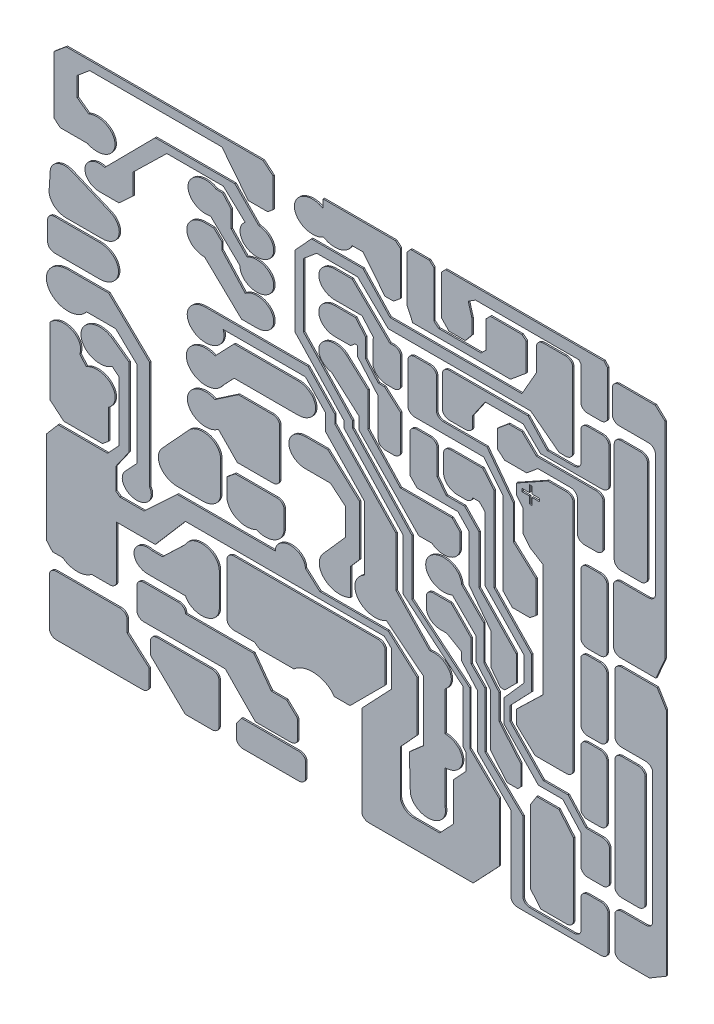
from build123d import *

# Parameters (mm, degrees)
EXTRUSION3_DEPTH    = 0.1
EXTRUSION3_2_DEPTH  = 0.1
EXTRUSION3_3_DEPTH  = 0.1
EXTRUSION3_4_DEPTH  = 0.1
EXTRUSION3_5_DEPTH  = 0.1
EXTRUSION3_6_DEPTH  = 0.1
EXTRUSION3_7_DEPTH  = 0.1
EXTRUSION3_8_DEPTH  = 0.1
EXTRUSION3_9_DEPTH  = 0.1
EXTRUSION3_10_DEPTH = 0.1
EXTRUSION3_11_DEPTH = 0.1
EXTRUSION3_12_DEPTH = 0.1
EXTRUSION3_13_DEPTH = 0.1
EXTRUSION3_14_DEPTH = 0.1
EXTRUSION3_15_DEPTH = 0.1
EXTRUSION3_16_DEPTH = 0.1
EXTRUSION3_17_DEPTH = 0.1
EXTRUSION3_18_DEPTH = 0.1
EXTRUSION3_19_DEPTH = 0.1
EXTRUSION3_20_DEPTH = 0.1
EXTRUSION3_21_DEPTH = 0.1
EXTRUSION3_22_DEPTH = 0.1
EXTRUSION3_23_DEPTH = 0.1
EXTRUSION3_24_DEPTH = 0.1
EXTRUSION3_25_DEPTH = 0.1
EXTRUSION3_26_DEPTH = 0.1
EXTRUSION3_27_DEPTH = 0.1
EXTRUSION3_28_DEPTH = 0.1
EXTRUSION3_29_DEPTH = 0.1
EXTRUSION3_30_DEPTH = 0.1
EXTRUSION3_31_DEPTH = 0.1
EXTRUSION3_32_DEPTH = 0.1
EXTRUSION3_33_DEPTH = 0.1
EXTRUSION3_34_DEPTH = 0.1
EXTRUSION3_35_DEPTH = 0.1
EXTRUSION3_36_DEPTH = 0.1
EXTRUSION3_37_DEPTH = 0.1
EXTRUSION3_38_DEPTH = 0.1
EXTRUSION3_39_DEPTH = 0.1
EXTRUSION3_40_DEPTH = 0.1
EXTRUSION3_41_DEPTH = 0.1
EXTRUSION3_42_DEPTH = 0.1
EXTRUSION3_43_DEPTH = 0.1
ECHELLE2_SCALE_X    = 1.03
ECHELLE2_SCALE_Y    = 0.86
ECHELLE2_SCALE_Z    = 1


with BuildPart() as part:
    # Esquisse4 → Extrusion3 (new body)
    with BuildSketch(Plane.XY):
        with BuildLine():
            Line((5.304256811, 19.782710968), (5.304256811, 17.323051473))
            Line((5.304256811, 17.323051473), (4.886048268, 16.90484293))
            Line((4.886048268, 16.90484293), (2.189324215, 16.90484293))
            Line((2.189324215, 16.90484293), (1.244749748, 17.849417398))
            Line((1.244749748, 17.849417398), (1.244749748, 23.495232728))
            ThreePointArc((1.244749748, 23.495232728), (2.735433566, 23.83894844), (3.294168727, 22.414836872))
            Line((3.294168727, 22.414836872), (3.754963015, 21.778893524))
            ThreePointArc((3.754963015, 21.778893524), (5.495315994, 21.530314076), (5.304256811, 19.782710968))
        make_face()
    extrude(amount=EXTRUSION3_DEPTH)


with BuildPart() as body_2:
    # Esquisse4 → Extrusion3 2 (new body)
    with BuildSketch(Plane.XY):
        with BuildLine():
            Line((8.159611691, 24.735437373), (8.159611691, 15.721101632))
            ThreePointArc((8.159611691, 15.721101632), (7.1608882, 14.244145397), (6.487654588, 15.895085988))
            Line((6.487654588, 15.895085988), (7.265510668, 16.885278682))
            Line((7.265510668, 16.885278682), (7.265510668, 24.072072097))
            Line((7.265510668, 24.072072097), (5.794570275, 25.744906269))
            Line((5.794570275, 25.744906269), (3.759509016, 25.744906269))
            ThreePointArc((3.759509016, 25.744906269), (1.170594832, 25.788310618), (2.4777439, 28.023421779))
            Line((2.4777439, 28.023421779), (5.304256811, 28.023421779))
            Line((5.304256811, 28.023421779), (8.159611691, 24.735437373))
        make_face()
    extrude(amount=EXTRUSION3_2_DEPTH)


with BuildPart() as body_3:
    # Esquisse4 → Extrusion3 3 (new body)
    with BuildSketch(Plane.XY):
        with BuildLine():
            Line((26.234351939, 7.440030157), (26.298853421, 4.671515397))
            ThreePointArc((26.298853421, 4.671515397), (27.683936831, 3.456761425), (28.707594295, 4.988495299))
            Line((28.707594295, 4.988495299), (28.707594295, 7.786235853))
            ThreePointArc((28.707594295, 7.786235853), (29.92978619, 9.008427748), (28.707594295, 10.230619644))
            Line((28.707594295, 10.230619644), (28.707594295, 13.466508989))
            ThreePointArc((28.707594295, 13.466508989), (29.026344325, 14.948417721), (27.652585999, 15.589076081))
            Line((27.652585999, 15.589076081), (25.299345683, 18.539459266))
            Line((25.299345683, 18.539459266), (25.299345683, 22.666557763))
            Line((25.299345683, 22.666557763), (21.04657529, 27.99848335))
            Line((21.04657529, 27.99848335), (21.04657529, 28.707460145))
            Line((21.04657529, 28.707460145), (19.185806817, 31.040405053))
            Line((19.185806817, 31.040405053), (12.058450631, 31.040405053))
            ThreePointArc((12.058450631, 31.040405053), (11.312990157, 28.717940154), (13.270856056, 30.172696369))
            Line((13.270856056, 30.172696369), (19.005379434, 30.172696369))
            Line((19.005379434, 30.172696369), (20.383022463, 28.445471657))
            Line((20.383022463, 28.445471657), (20.383022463, 27.07878426))
            Line((20.383022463, 27.07878426), (23.097556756, 23.675427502))
            Line((23.097556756, 23.675427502), (23.097556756, 18.313534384))
            ThreePointArc((23.097556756, 18.313534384), (22.67184234, 16.349325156), (24.642456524, 15.95431833))
            Line((24.642456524, 15.95431833), (27.230443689, 13.484176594))
            Line((27.230443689, 13.484176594), (27.230443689, 8.483643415))
            Line((27.230443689, 8.483643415), (26.234351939, 7.440030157))
        make_face()
    extrude(amount=EXTRUSION3_3_DEPTH)


with BuildPart() as body_4:
    # Esquisse4 → Extrusion3 4 (new body)
    with BuildSketch(Plane.XY):
        with BuildLine():
            Line((18.475414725, 29.578565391), (14.039868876, 29.578565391))
            Line((14.039868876, 29.578565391), (12.710033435, 27.918640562))
            ThreePointArc((12.710033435, 27.918640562), (10.766673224, 26.373119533), (13.233678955, 26.091753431))
            Line((13.233678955, 26.091753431), (14.039868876, 27.105323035))
            Line((14.039868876, 27.105323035), (18.475414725, 27.105323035))
            ThreePointArc((18.475414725, 27.105323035), (19.712035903, 28.341944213), (18.475414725, 29.578565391))
        make_face()
    extrude(amount=EXTRUSION3_4_DEPTH)


with BuildPart() as body_5:
    # Esquisse4 → Extrusion3 5 (new body)
    with BuildSketch(Plane.XY):
        with BuildLine():
            Line((22.13997135, 16.130453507), (22.13997135, 18.374285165))
            Line((22.13997135, 18.374285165), (22.757757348, 19.22841254))
            Line((22.757757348, 19.22841254), (22.757757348, 23.449301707))
            Line((22.757757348, 23.449301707), (20.556318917, 25.859676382))
            Line((20.556318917, 25.859676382), (19.005379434, 25.859676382))
            ThreePointArc((19.005379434, 25.859676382), (17.847387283, 24.701684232), (19.005379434, 23.543692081))
            Line((19.005379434, 23.543692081), (20.747633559, 23.543692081))
            Line((20.747633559, 23.543692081), (21.7827533, 22.50857234))
            Line((21.7827533, 22.50857234), (21.7827533, 20.252080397))
            Line((21.7827533, 20.252080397), (20.241433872, 18.16266977))
            ThreePointArc((20.241433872, 18.16266977), (20.346098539, 16.357515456), (22.13997135, 16.130453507))
        make_face()
    extrude(amount=EXTRUSION3_5_DEPTH)


with BuildPart() as body_6:
    # Esquisse4 → Extrusion3 6 (new body)
    with BuildSketch(Plane.XY):
        with BuildLine():
            Line((14.10875337, 20.252080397), (17.010353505, 20.252080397))
            ThreePointArc((17.010353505, 20.252080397), (17.363906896, 20.105633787), (17.510353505, 19.752080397))
            Line((17.510353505, 19.752080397), (17.510353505, 18.256156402))
            ThreePointArc((17.510353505, 18.256156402), (16.875021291, 17.132890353), (15.584982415, 17.098636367))
            ThreePointArc((15.584982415, 17.098636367), (14.224165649, 17.080572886), (13.538489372, 18.256156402))
            Line((13.538489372, 18.256156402), (13.538489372, 19.681816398))
            Line((13.538489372, 19.681816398), (14.10875337, 20.252080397))
        make_face()
    extrude(amount=EXTRUSION3_6_DEPTH)


with BuildPart() as body_7:
    # Esquisse4 → Extrusion3 7 (new body)
    with BuildSketch(Plane.XY):
        with BuildLine():
            Line((11.990059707, 37.105055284), (12.61713863, 37.105055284))
            Line((12.61713863, 37.105055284), (13.183371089, 36.454771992))
            Line((13.183371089, 36.454771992), (13.183371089, 35.842473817))
            Line((13.183371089, 35.842473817), (14.810614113, 33.694689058))
            ThreePointArc((14.810614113, 33.694689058), (16.710999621, 33.286992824), (15.623122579, 31.676339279))
            Line((15.623122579, 31.676339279), (14.554116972, 31.676339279))
            Line((14.554116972, 31.676339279), (11.990059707, 34.621001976))
            ThreePointArc((11.990059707, 34.621001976), (10.748033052, 35.86302863), (11.990059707, 37.105055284))
        make_face()
    extrude(amount=EXTRUSION3_7_DEPTH)


with BuildPart() as body_8:
    # Esquisse4 → Extrusion3 8 (new body)
    with BuildSketch(Plane.XY):
        with BuildLine():
            Line((14.450926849, 35.468375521), (12.399096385, 37.828891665))
            ThreePointArc((12.399096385, 37.828891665), (10.851053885, 39.227517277), (12.792475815, 39.991369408))
            Line((12.792475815, 39.991369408), (13.233678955, 39.991369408))
            Line((13.233678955, 39.991369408), (13.839788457, 39.180456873))
            Line((13.839788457, 39.180456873), (13.839788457, 37.758857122))
            Line((13.839788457, 37.758857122), (14.942842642, 36.388657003))
            ThreePointArc((14.942842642, 36.388657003), (16.657359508, 34.880588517), (14.450926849, 35.468375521))
        make_face()
    extrude(amount=EXTRUSION3_8_DEPTH)


with BuildPart() as body_9:
    # Esquisse4 → Extrusion3 9 (new body)
    with BuildSketch(Plane.XY):
        with BuildLine():
            Line((34.67299222, 8.717287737), (34.67299222, 2.583722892))
            Line((34.67299222, 2.583722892), (35.388883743, 1.56851013))
            Line((35.388883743, 1.56851013), (37.155420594, 1.56851013))
            ThreePointArc((37.155420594, 1.56851013), (37.508973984, 1.71495674), (37.655420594, 2.06851013))
            Line((37.655420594, 2.06851013), (37.655420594, 8.081678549))
            Line((37.655420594, 8.081678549), (36.640002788, 9.521652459))
            Line((36.640002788, 9.521652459), (35.096709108, 9.521652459))
            Line((35.096709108, 9.521652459), (34.67299222, 8.717287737))
        make_face()
    extrude(amount=EXTRUSION3_9_DEPTH)


with BuildPart() as body_10:
    # Esquisse4 → Extrusion3 10 (new body)
    with BuildSketch(Plane.XY):
        with BuildLine():
            Line((38.663806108, 15.532381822), (39.483987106, 15.532381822))
            ThreePointArc((39.483987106, 15.532381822), (39.837540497, 15.385935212), (39.983987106, 15.032381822))
            Line((39.983987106, 15.032381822), (39.983987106, 10.472851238))
            ThreePointArc((39.983987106, 10.472851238), (39.837540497, 10.119297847), (39.483987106, 9.972851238))
            Line((39.483987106, 9.972851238), (38.663806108, 9.972851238))
            ThreePointArc((38.663806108, 9.972851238), (38.310252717, 10.119297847), (38.163806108, 10.472851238))
            Line((38.163806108, 10.472851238), (38.163806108, 15.032381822))
            ThreePointArc((38.163806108, 15.032381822), (38.310252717, 15.385935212), (38.663806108, 15.532381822))
        make_face()
    extrude(amount=EXTRUSION3_10_DEPTH)


with BuildPart() as body_11:
    # Esquisse4 → Extrusion3 11 (new body)
    with BuildSketch(Plane.XY):
        with BuildLine():
            Line((13.285235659, 40.518395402), (14.806877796, 38.823997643))
            ThreePointArc((14.806877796, 38.823997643), (16.006266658, 36.873609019), (15.745099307, 39.148326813))
            Line((15.745099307, 39.148326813), (14.088260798, 41.172698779))
            Line((14.088260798, 41.172698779), (8.550123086, 41.172698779))
            Line((8.550123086, 41.172698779), (5.035022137, 36.925423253))
            ThreePointArc((5.035022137, 36.925423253), (3.676567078, 36.156617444), (4.676473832, 34.958014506))
            Line((4.676473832, 34.958014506), (6.023296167, 34.958014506))
            Line((6.023296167, 34.958014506), (6.993680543, 36.024298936))
            Line((6.993680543, 36.024298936), (6.993680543, 37.757231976))
            Line((6.993680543, 37.757231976), (9.358340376, 40.518395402))
            Line((9.358340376, 40.518395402), (13.285235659, 40.518395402))
        make_face()
    extrude(amount=EXTRUSION3_11_DEPTH)


with BuildPart() as body_12:
    # Esquisse4 → Extrusion3 12 (new body)
    with BuildSketch(Plane.XY):
        with BuildLine():
            Line((2.354013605, 44.027142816), (16.050849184, 44.027142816))
            Line((16.050849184, 44.027142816), (16.747298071, 43.330693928))
            Line((16.747298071, 43.330693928), (16.747298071, 40.882612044))
            Line((16.747298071, 40.882612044), (16.367259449, 40.518395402))
            Line((16.367259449, 40.518395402), (15.024456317, 40.518395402))
            Line((15.024456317, 40.518395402), (13.191788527, 43.289452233))
            Line((13.191788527, 43.289452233), (3.990668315, 43.289452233))
            Line((3.990668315, 43.289452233), (3.124097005, 42.422880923))
            Line((3.124097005, 42.422880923), (3.124097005, 40.806533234))
            Line((3.124097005, 40.806533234), (3.916263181, 40.12072385))
            ThreePointArc((3.916263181, 40.12072385), (5.750915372, 38.960873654), (3.834597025, 37.941596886))
            Line((3.834597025, 37.941596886), (1.943711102, 37.941596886))
            Line((1.943711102, 37.941596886), (1.52041727, 38.364890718))
            Line((1.52041727, 38.364890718), (1.52041727, 43.193546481))
            Line((1.52041727, 43.193546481), (2.354013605, 44.027142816))
        make_face()
    extrude(amount=EXTRUSION3_12_DEPTH)


with BuildPart() as body_13:
    # Esquisse4 → Extrusion3 13 (new body)
    with BuildSketch(Plane.XY):
        with BuildLine():
            Line((38.663806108, 21.828619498), (39.483987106, 21.828619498))
            ThreePointArc((39.483987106, 21.828619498), (39.837540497, 21.682172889), (39.983987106, 21.328619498))
            Line((39.983987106, 21.328619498), (39.983987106, 16.520553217))
            ThreePointArc((39.983987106, 16.520553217), (39.837540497, 16.166999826), (39.483987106, 16.020553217))
            Line((39.483987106, 16.020553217), (38.663806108, 16.020553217))
            ThreePointArc((38.663806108, 16.020553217), (38.310252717, 16.166999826), (38.163806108, 16.520553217))
            Line((38.163806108, 16.520553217), (38.163806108, 21.328619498))
            ThreePointArc((38.163806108, 21.328619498), (38.310252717, 21.682172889), (38.663806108, 21.828619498))
        make_face()
    extrude(amount=EXTRUSION3_13_DEPTH)


with BuildPart() as body_14:
    # Esquisse4 → Extrusion3 14 (new body)
    with BuildSketch(Plane.XY):
        with BuildLine():
            Line((12.489755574, 5.183728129), (8.719579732, 5.183728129))
            ThreePointArc((8.719579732, 5.183728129), (8.369172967, 5.038584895), (8.224029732, 4.688178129))
            Line((8.224029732, 4.688178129), (8.224029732, 3.617699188))
            Line((8.224029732, 3.617699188), (10.644366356, 0.812706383))
            Line((10.644366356, 0.812706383), (12.489755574, 0.812706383))
            ThreePointArc((12.489755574, 0.812706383), (12.840162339, 0.957849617), (12.985305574, 1.308256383))
            Line((12.985305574, 1.308256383), (12.985305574, 4.688178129))
            ThreePointArc((12.985305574, 4.688178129), (12.840162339, 5.038584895), (12.489755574, 5.183728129))
        make_face()
    extrude(amount=EXTRUSION3_14_DEPTH)


with BuildPart() as body_15:
    # Esquisse4 → Extrusion3 15 (new body)
    with BuildSketch(Plane.XY):
        with BuildLine():
            Line((9.040313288, 19.066494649), (10.818019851, 21.378964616))
            ThreePointArc((10.818019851, 21.378964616), (12.210528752, 21.900874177), (13.102347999, 20.710861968))
            Line((13.102347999, 20.710861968), (13.102347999, 18.16644321))
            ThreePointArc((13.102347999, 18.16644321), (12.739199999, 17.289726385), (11.862483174, 16.926578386))
            Line((11.862483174, 16.926578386), (10.094414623, 16.926578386))
            ThreePointArc((10.094414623, 16.926578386), (8.901689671, 17.668632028), (9.040313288, 19.066494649))
        make_face()
    extrude(amount=EXTRUSION3_15_DEPTH)


with BuildPart() as body_16:
    # Esquisse4 → Extrusion3 16 (new body)
    with BuildSketch(Plane.XY):
        with BuildLine():
            Line((16.710352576, 26.091753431), (14.330747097, 26.091753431))
            Line((14.330747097, 26.091753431), (12.704808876, 24.767535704))
            ThreePointArc((12.704808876, 24.767535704), (10.798483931, 23.5238913), (12.945326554, 22.76772138))
            Line((12.945326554, 22.76772138), (14.259146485, 21.154550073))
            Line((14.259146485, 21.154550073), (16.710352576, 21.154550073))
            ThreePointArc((16.710352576, 21.154550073), (17.063905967, 21.300996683), (17.210352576, 21.654550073))
            Line((17.210352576, 21.654550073), (17.210352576, 25.591753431))
            ThreePointArc((17.210352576, 25.591753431), (17.063905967, 25.945306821), (16.710352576, 26.091753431))
        make_face()
    extrude(amount=EXTRUSION3_16_DEPTH)


with BuildPart() as body_17:
    # Esquisse4 → Extrusion3 17 (new body)
    with BuildSketch(Plane.XY):
        with BuildLine():
            Line((4.676473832, 31.296328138), (1.56685908, 31.296328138))
            ThreePointArc((1.56685908, 31.296328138), (1.213305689, 31.149881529), (1.06685908, 30.796328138))
            Line((1.06685908, 30.796328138), (1.06685908, 29.157186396))
            ThreePointArc((1.06685908, 29.157186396), (1.213305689, 28.803633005), (1.56685908, 28.657186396))
            Line((1.56685908, 28.657186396), (4.676473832, 28.657186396))
            ThreePointArc((4.676473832, 28.657186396), (5.996044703, 29.976757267), (4.676473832, 31.296328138))
        make_face()
    extrude(amount=EXTRUSION3_17_DEPTH)


with BuildPart() as body_18:
    # Esquisse4 → Extrusion3 18 (new body)
    with BuildSketch(Plane.XY):
        with BuildLine():
            Line((38.663806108, 28.249125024), (39.483987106, 28.249125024))
            ThreePointArc((39.483987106, 28.249125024), (39.837540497, 28.102678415), (39.983987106, 27.749125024))
            Line((39.983987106, 27.749125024), (39.983987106, 22.816790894))
            ThreePointArc((39.983987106, 22.816790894), (39.837540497, 22.463237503), (39.483987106, 22.316790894))
            Line((39.483987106, 22.316790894), (38.663806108, 22.316790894))
            ThreePointArc((38.663806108, 22.316790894), (38.310252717, 22.463237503), (38.163806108, 22.816790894))
            Line((38.163806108, 22.816790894), (38.163806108, 27.749125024))
            ThreePointArc((38.163806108, 27.749125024), (38.310252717, 28.102678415), (38.663806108, 28.249125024))
        make_face()
    extrude(amount=EXTRUSION3_18_DEPTH)


with BuildPart() as body_19:
    # Esquisse4 → Extrusion3 19 (new body)
    with BuildSketch(Plane.XY):
        with BuildLine():
            Line((6.091595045, 5.759335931), (1.686371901, 5.759335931))
            ThreePointArc((1.686371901, 5.759335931), (1.335965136, 5.614192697), (1.190821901, 5.263785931))
            Line((1.190821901, 5.263785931), (1.190821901, 1.308256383))
            ThreePointArc((1.190821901, 1.308256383), (1.335965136, 0.957849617), (1.686371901, 0.812706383))
            Line((1.686371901, 0.812706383), (7.638541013, 0.812706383))
            ThreePointArc((7.638541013, 0.812706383), (7.988947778, 0.957849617), (8.134091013, 1.308256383))
            Line((8.134091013, 1.308256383), (8.134091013, 2.629468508))
            Line((8.134091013, 2.629468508), (6.587145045, 4.266353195))
            Line((6.587145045, 4.266353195), (6.587145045, 5.263785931))
            ThreePointArc((6.587145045, 5.263785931), (6.44200181, 5.614192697), (6.091595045, 5.759335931))
        make_face()
    extrude(amount=EXTRUSION3_19_DEPTH)


with BuildPart() as body_20:
    # Esquisse4 → Extrusion3 20 (new body)
    with BuildSketch(Plane.XY):
        with BuildLine():
            Line((13.007320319, 9.838041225), (13.007320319, 12.598886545))
            ThreePointArc((13.007320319, 12.598886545), (12.020275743, 13.800456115), (10.649918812, 13.06550829))
            Line((10.649918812, 13.06550829), (9.054118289, 11.237906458))
            Line((9.054118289, 11.237906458), (8.33555072, 11.237906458))
            ThreePointArc((8.33555072, 11.237906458), (7.084357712, 10.48446694), (8.030021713, 9.37141948))
            Line((8.030021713, 9.37141948), (10.649918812, 9.37141948))
            ThreePointArc((10.649918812, 9.37141948), (12.020275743, 8.636471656), (13.007320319, 9.838041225))
        make_face()
    extrude(amount=EXTRUSION3_20_DEPTH)


with BuildPart() as body_21:
    # Esquisse4 → Extrusion3 21 (new body)
    with BuildSketch(Plane.XY):
        with BuildLine():
            Line((33.294770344, 7.480250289), (30.959667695, 10.30520257))
            Line((30.959667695, 10.30520257), (30.959667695, 14.720309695))
            Line((30.959667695, 14.720309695), (29.867790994, 16.187683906))
            Line((29.867790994, 16.187683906), (29.867790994, 16.846409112))
            Line((29.867790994, 16.846409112), (28.840778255, 17.558186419))
            Line((28.840778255, 17.558186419), (28.415681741, 17.558186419))
            ThreePointArc((28.415681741, 17.558186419), (27.70857496, 17.851079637), (27.415681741, 18.558186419))
            Line((27.415681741, 18.558186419), (27.415681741, 19.406639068))
            ThreePointArc((27.415681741, 19.406639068), (27.56212835, 19.760192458), (27.915681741, 19.906639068))
            Line((27.915681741, 19.906639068), (29.144650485, 19.906639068))
            Line((29.144650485, 19.906639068), (30.534071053, 18.225750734))
            Line((30.534071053, 18.225750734), (30.534071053, 16.351324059))
            Line((30.534071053, 16.351324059), (31.495750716, 15.187906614))
            Line((31.495750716, 15.187906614), (31.495750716, 10.574515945))
            Line((31.495750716, 10.574515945), (34.133551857, 7.541962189))
            Line((34.133551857, 7.541962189), (34.133551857, 1.710557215))
            ThreePointArc((34.133551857, 1.710557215), (34.279998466, 1.357003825), (34.633551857, 1.210557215))
            Line((34.633551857, 1.210557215), (37.677156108, 1.210557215))
            ThreePointArc((37.677156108, 1.210557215), (38.030709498, 1.357003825), (38.177156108, 1.710557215))
            Line((38.177156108, 1.710557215), (38.177156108, 4.092383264))
            ThreePointArc((38.177156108, 4.092383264), (38.323602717, 4.445936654), (38.677156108, 4.592383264))
            Line((38.677156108, 4.592383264), (39.556559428, 4.592383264))
            ThreePointArc((39.556559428, 4.592383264), (39.910112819, 4.445936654), (40.056559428, 4.092383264))
            Line((40.056559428, 4.092383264), (40.056559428, 1.228484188))
            ThreePointArc((40.056559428, 1.228484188), (39.910112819, 0.874930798), (39.556559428, 0.728484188))
            Line((39.556559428, 0.728484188), (33.794770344, 0.728484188))
            ThreePointArc((33.794770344, 0.728484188), (33.441216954, 0.874930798), (33.294770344, 1.228484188))
            Line((33.294770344, 1.228484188), (33.294770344, 7.480250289))
        make_face()
    extrude(amount=EXTRUSION3_21_DEPTH)


with BuildPart() as body_22:
    # Esquisse4 → Extrusion3 22 (new body)
    with BuildSketch(Plane.XY):
        with BuildLine():
            Line((24.055930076, 14.264261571), (14.046162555, 14.264261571))
            ThreePointArc((14.046162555, 14.264261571), (13.69575579, 14.119118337), (13.550612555, 13.768711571))
            Line((13.550612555, 13.768711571), (13.550612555, 9.398536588))
            ThreePointArc((13.550612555, 9.398536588), (13.69575579, 9.048129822), (14.046162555, 8.902986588))
            Line((14.046162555, 8.902986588), (15.455020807, 8.902986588))
            Line((15.455020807, 8.902986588), (15.820576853, 8.610020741))
            Line((15.820576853, 8.610020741), (18.201768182, 8.610020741))
            ThreePointArc((18.201768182, 8.610020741), (19.6882062, 9.172023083), (21.018285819, 8.302406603))
            Line((21.018285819, 8.302406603), (22.105215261, 8.302406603))
            Line((22.105215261, 8.302406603), (24.551480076, 11.237906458))
            Line((24.551480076, 11.237906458), (24.551480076, 13.768711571))
            ThreePointArc((24.551480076, 13.768711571), (24.406336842, 14.119118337), (24.055930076, 14.264261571))
        make_face()
    extrude(amount=EXTRUSION3_22_DEPTH)


with BuildPart() as body_23:
    # Esquisse4 → Extrusion3 23 (new body)
    with BuildSketch(Plane.XY):
        with BuildLine():
            Line((36.907578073, 10.411348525), (38.172650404, 8.740666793))
            Line((38.172650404, 8.740666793), (38.172650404, 6.314354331))
            ThreePointArc((38.172650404, 6.314354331), (38.319097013, 5.960800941), (38.672650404, 5.814354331))
            Line((38.672650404, 5.814354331), (39.662472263, 5.814354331))
            ThreePointArc((39.662472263, 5.814354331), (40.016025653, 5.960800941), (40.162472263, 6.314354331))
            Line((40.162472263, 6.314354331), (40.162472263, 8.800202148))
            ThreePointArc((40.162472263, 8.800202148), (40.016025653, 9.153755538), (39.662472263, 9.300202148))
            Line((39.662472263, 9.300202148), (38.527819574, 9.300202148))
            Line((38.527819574, 9.300202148), (37.277061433, 10.951980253))
            Line((37.277061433, 10.951980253), (35.54998411, 10.951980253))
            Line((35.54998411, 10.951980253), (33.231795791, 13.839032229))
            Line((33.231795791, 13.839032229), (33.231795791, 14.971536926))
            Line((33.231795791, 14.971536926), (34.737262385, 16.855309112))
            Line((34.737262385, 16.855309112), (34.737262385, 19.570333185))
            Line((34.737262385, 19.570333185), (32.130957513, 22.81620306))
            Line((32.130957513, 22.81620306), (32.130957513, 29.839724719))
            Line((32.130957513, 29.839724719), (31.338064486, 30.966362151))
            Line((31.338064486, 30.966362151), (29.117585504, 30.966362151))
            ThreePointArc((29.117585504, 30.966362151), (28.764032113, 30.819915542), (28.617585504, 30.466362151))
            Line((28.617585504, 30.466362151), (28.617585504, 28.99450928))
            ThreePointArc((28.617585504, 28.99450928), (28.910478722, 28.287402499), (29.617585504, 27.99450928))
            Line((29.617585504, 27.99450928), (30.149139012, 27.99450928))
            ThreePointArc((30.149139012, 27.99450928), (30.473613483, 28.1140933), (30.642880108, 28.415644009))
            Line((30.642880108, 28.415644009), (31.102238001, 28.415644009))
            Line((31.102238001, 28.415644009), (31.500145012, 27.920094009))
            Line((31.500145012, 27.920094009), (31.500145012, 22.586011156))
            Line((31.500145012, 22.586011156), (34.20387358, 19.21881064))
            Line((34.20387358, 19.21881064), (34.20387358, 17.17223595))
            Line((34.20387358, 17.17223595), (32.827825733, 15.298216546))
            Line((32.827825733, 15.298216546), (32.827825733, 13.383297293))
            Line((32.827825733, 13.383297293), (35.214182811, 10.411348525))
            Line((35.214182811, 10.411348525), (36.907578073, 10.411348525))
        make_face()
    extrude(amount=EXTRUSION3_23_DEPTH)


with BuildPart() as body_24:
    # Esquisse4 → Extrusion3 24 (new body)
    with BuildSketch(Plane.XY):
        with BuildLine():
            Line((14.565437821, 2.876788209), (18.520522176, 2.876788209))
            ThreePointArc((18.520522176, 2.876788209), (18.874075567, 2.730341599), (19.020522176, 2.376788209))
            Line((19.020522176, 2.376788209), (19.020522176, 1.225890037))
            ThreePointArc((19.020522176, 1.225890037), (18.874075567, 0.872336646), (18.520522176, 0.725890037))
            Line((18.520522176, 0.725890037), (14.696459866, 0.725890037))
            ThreePointArc((14.696459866, 0.725890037), (14.342906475, 0.872336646), (14.196459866, 1.225890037))
            Line((14.196459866, 1.225890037), (14.196459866, 2.290764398))
            Line((14.196459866, 2.290764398), (14.565437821, 2.876788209))
        make_face()
    extrude(amount=EXTRUSION3_24_DEPTH)


with BuildPart() as body_25:
    # Esquisse4 → Extrusion3 25 (new body)
    with BuildSketch(Plane.XY):
        with BuildLine():
            Line((13.421606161, 5.759335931), (15.53204492, 3.19041947))
            Line((15.53204492, 3.19041947), (17.967057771, 3.19041947))
            ThreePointArc((17.967057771, 3.19041947), (18.320611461, 3.336866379), (18.467057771, 3.690420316))
            Line((18.467057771, 3.690420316), (18.467055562, 4.995728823))
            ThreePointArc((18.467055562, 4.995728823), (18.435066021, 5.171700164), (18.343191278, 5.325154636))
            Line((18.343191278, 5.325154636), (17.692201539, 6.068447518))
            Line((17.692201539, 6.068447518), (16.633473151, 6.068447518))
            Line((16.633473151, 6.068447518), (15.404538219, 8.073500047))
            Line((15.404538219, 8.073500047), (10.653266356, 8.073500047))
            Line((10.653266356, 8.073500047), (10.653266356, 8.114470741))
            ThreePointArc((10.653266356, 8.114470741), (10.506819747, 8.468024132), (10.153266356, 8.614470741))
            Line((10.153266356, 8.614470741), (7.778123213, 8.614470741))
            ThreePointArc((7.778123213, 8.614470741), (7.424569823, 8.468024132), (7.278123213, 8.114470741))
            Line((7.278123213, 8.114470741), (7.278123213, 6.254885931))
            ThreePointArc((7.278123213, 6.254885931), (7.423266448, 5.904479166), (7.773673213, 5.759335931))
            Line((7.773673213, 5.759335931), (13.421606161, 5.759335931))
        make_face()
    extrude(amount=EXTRUSION3_25_DEPTH)


with BuildPart() as body_26:
    # Esquisse4 → Extrusion3 26 (new body)
    with BuildSketch(Plane.XY):
        with BuildLine():
            Line((1.245300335, 34.416193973), (1.166218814, 32.96581242))
            ThreePointArc((1.166218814, 32.96581242), (1.499355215, 32.05838533), (2.387299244, 31.676339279))
            Line((2.387299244, 31.676339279), (4.851255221, 31.676339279))
            ThreePointArc((4.851255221, 31.676339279), (6.01635138, 32.597583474), (5.388621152, 33.943724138))
            Line((5.388621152, 33.943724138), (2.731685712, 35.278047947))
            ThreePointArc((2.731685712, 35.278047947), (1.755625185, 35.248733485), (1.245300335, 34.416193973))
        make_face()
    extrude(amount=EXTRUSION3_26_DEPTH)


with BuildPart() as body_27:
    # Esquisse4 → Extrusion3 27 (new body)
    with BuildSketch(Plane.XY):
        with BuildLine():
            Line((20.241433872, 43.755886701), (25.258316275, 43.755886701))
            Line((25.258316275, 43.755886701), (25.60063397, 43.413569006))
            Line((25.60063397, 43.413569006), (25.60063397, 39.773621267))
            Line((25.60063397, 39.773621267), (25.135406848, 39.308394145))
            Line((25.135406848, 39.308394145), (24.538653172, 39.308394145))
            Line((24.538653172, 39.308394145), (22.993753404, 41.593595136))
            Line((22.993753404, 41.593595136), (22.245747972, 41.593595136))
            ThreePointArc((22.245747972, 41.593595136), (21.40022707, 40.805217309), (20.264798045, 41.022579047))
            ThreePointArc((20.264798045, 41.022579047), (18.233285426, 42.017562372), (20.241433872, 43.058895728))
            Line((20.241433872, 43.058895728), (20.241433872, 43.755886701))
        make_face()
    extrude(amount=EXTRUSION3_27_DEPTH)


with BuildPart() as body_28:
    # Esquisse4 → Extrusion3 28 (new body)
    with BuildSketch(Plane.XY):
        Polygon((26.324358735, 43.755886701), (27.633366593, 43.755886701), (27.937741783, 43.413569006), (27.937741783, 39.549598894), (28.268204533, 39.219136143), (31.226884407, 39.219136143), (31.575860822, 39.640160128), (31.575860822, 41.900508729), (31.870843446, 42.256391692), (34.065406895, 42.256391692), (34.367644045, 41.954154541), (34.367644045, 39.640160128), (33.272010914, 38.544526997), (26.473059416, 38.544526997), (26.069518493, 39.563945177), (26.069518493, 43.413569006), align=None)
    extrude(amount=EXTRUSION3_28_DEPTH)


with BuildPart() as body_29:
    # Esquisse4 → Extrusion3 29 (new body)
    with BuildSketch(Plane.XY):
        with BuildLine():
            Line((28.478543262, 40.091572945), (28.478543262, 43.413569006))
            Line((28.478543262, 43.413569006), (28.753419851, 43.755886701))
            Line((28.753419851, 43.755886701), (39.774332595, 43.755886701))
            Line((39.774332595, 43.755886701), (40.032029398, 43.413569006))
            Line((40.032029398, 43.413569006), (40.032029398, 39.803944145))
            ThreePointArc((40.032029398, 39.803944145), (39.885582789, 39.450390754), (39.532029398, 39.303944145))
            Line((39.532029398, 39.303944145), (38.663806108, 39.303944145))
            ThreePointArc((38.663806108, 39.303944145), (38.310252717, 39.450390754), (38.163806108, 39.803944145))
            Line((38.163806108, 39.803944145), (38.163806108, 42.621044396))
            Line((38.163806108, 42.621044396), (38.026426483, 42.803535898))
            Line((38.026426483, 42.803535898), (30.83840426, 42.803535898))
            Line((30.83840426, 42.803535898), (30.332752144, 42.422880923))
            Line((30.332752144, 42.422880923), (30.585578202, 41.360981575))
            Line((30.585578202, 41.360981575), (30.585578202, 40.124645))
            Line((30.585578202, 40.124645), (30.118753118, 39.454056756))
            Line((30.118753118, 39.454056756), (28.99079683, 39.454056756))
            Line((28.99079683, 39.454056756), (28.478543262, 40.091572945))
        make_face()
    extrude(amount=EXTRUSION3_29_DEPTH)


with BuildPart() as body_30:
    # Esquisse4 → Extrusion3 30 (new body)
    with BuildSketch(Plane.XY):
        with BuildLine():
            Line((40.86468052, 42.704044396), (43.350463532, 42.704044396))
            Line((43.350463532, 42.704044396), (44.026232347, 41.948235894))
            Line((44.026232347, 41.948235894), (44.026232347, 24.784684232))
            Line((44.026232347, 24.784684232), (43.390469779, 23.027246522))
            Line((43.390469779, 23.027246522), (40.944182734, 23.027246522))
            ThreePointArc((40.944182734, 23.027246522), (40.590629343, 23.173693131), (40.444182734, 23.527246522))
            Line((40.444182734, 23.527246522), (40.444182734, 28.01714591))
            ThreePointArc((40.444182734, 28.01714591), (40.590629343, 28.370699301), (40.944182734, 28.51714591))
            Line((40.944182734, 28.51714591), (42.850463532, 28.51714591))
            ThreePointArc((42.850463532, 28.51714591), (43.204016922, 28.66359252), (43.350463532, 29.01714591))
            Line((43.350463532, 29.01714591), (43.350463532, 39.214260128))
            ThreePointArc((43.350463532, 39.214260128), (43.204016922, 39.567813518), (42.850463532, 39.714260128))
            Line((42.850463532, 39.714260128), (40.86468052, 39.714260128))
            ThreePointArc((40.86468052, 39.714260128), (40.51112713, 39.860706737), (40.36468052, 40.214260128))
            Line((40.36468052, 40.214260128), (40.36468052, 42.204044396))
            ThreePointArc((40.36468052, 42.204044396), (40.51112713, 42.557597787), (40.86468052, 42.704044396))
        make_face()
    extrude(amount=EXTRUSION3_30_DEPTH)


with BuildPart() as body_31:
    # Esquisse4 → Extrusion3 31 (new body)
    with BuildSketch(Plane.XY):
        with BuildLine():
            Line((31.870843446, 10.951980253), (33.033076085, 9.300202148))
            Line((33.033076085, 9.300202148), (33.781420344, 9.300202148))
            Line((33.781420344, 9.300202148), (33.993043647, 9.566678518))
            Line((33.993043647, 9.566678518), (33.993043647, 11.22245083))
            Line((33.993043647, 11.22245083), (32.489094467, 13.359880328))
            Line((32.489094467, 13.359880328), (32.489094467, 15.456489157))
            Line((32.489094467, 15.456489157), (31.412807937, 16.986119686))
            Line((31.412807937, 16.986119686), (31.412807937, 19.842763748))
            Line((31.412807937, 19.842763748), (29.870768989, 21.69061986))
            ThreePointArc((29.870768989, 21.69061986), (27.53671871, 22.269022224), (29.223015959, 20.554746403))
            Line((29.223015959, 20.554746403), (30.889148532, 18.558186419))
            Line((30.889148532, 18.558186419), (30.889148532, 16.703014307))
            Line((30.889148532, 16.703014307), (31.870843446, 15.307818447))
            Line((31.870843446, 15.307818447), (31.870843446, 10.951980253))
        make_face()
    extrude(amount=EXTRUSION3_31_DEPTH)


with BuildPart() as body_32:
    # Esquisse4 → Extrusion3 32 (new body)
    with BuildSketch(Plane.XY):
        with BuildLine():
            Line((31.907158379, 16.93944259), (32.57617701, 15.881446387))
            Line((32.57617701, 15.881446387), (32.875204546, 15.881446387))
            Line((32.875204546, 15.881446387), (33.67305446, 16.840447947))
            Line((33.67305446, 16.840447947), (33.67305446, 18.966535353))
            Line((33.67305446, 18.966535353), (31.076991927, 22.199649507))
            Line((31.076991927, 22.199649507), (31.076991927, 26.226925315))
            Line((31.076991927, 26.226925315), (30.07581074, 27.473787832))
            Line((30.07581074, 27.473787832), (28.792863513, 27.473787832))
            Line((28.792863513, 27.473787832), (28.172122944, 28.455436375))
            Line((28.172122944, 28.455436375), (28.172122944, 30.533712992))
            ThreePointArc((28.172122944, 30.533712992), (28.025676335, 30.887266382), (27.672122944, 31.033712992))
            Line((27.672122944, 31.033712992), (26.767656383, 31.033712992))
            ThreePointArc((26.767656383, 31.033712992), (26.414102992, 30.887266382), (26.267656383, 30.533712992))
            Line((26.267656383, 30.533712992), (26.267656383, 27.432226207))
            Line((26.267656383, 27.432226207), (26.772303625, 26.803742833))
            Line((26.772303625, 26.803742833), (29.613135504, 26.803742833))
            Line((29.613135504, 26.803742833), (30.371183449, 25.859676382))
            Line((30.371183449, 25.859676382), (30.371183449, 21.999347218))
            Line((30.371183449, 21.999347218), (31.907158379, 19.570333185))
            Line((31.907158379, 19.570333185), (31.907158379, 16.93944259))
        make_face()
    extrude(amount=EXTRUSION3_32_DEPTH)


with BuildPart() as body_33:
    # Esquisse4 → Extrusion3 33 (new body)
    with BuildSketch(Plane.XY):
        with BuildLine():
            Line((25.124589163, 28.211867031), (24.568157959, 28.211867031))
            ThreePointArc((24.568157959, 28.211867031), (24.214604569, 28.358313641), (24.068157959, 28.711867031))
            Line((24.068157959, 28.711867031), (24.068157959, 31.827740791))
            Line((24.068157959, 31.827740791), (22.619524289, 33.822736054))
            Line((22.619524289, 33.822736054), (22.619524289, 34.610432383))
            Line((22.619524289, 34.610432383), (22.444615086, 34.610432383))
            Line((22.444615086, 34.610432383), (22.141918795, 34.307736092))
            Line((22.141918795, 34.307736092), (21.047429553, 34.307736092))
            ThreePointArc((21.047429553, 34.307736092), (19.931108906, 35.424056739), (21.047429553, 36.540377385))
            Line((21.047429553, 36.540377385), (22.476208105, 36.540377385))
            Line((22.476208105, 36.540377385), (23.186550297, 35.562125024))
            Line((23.186550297, 35.562125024), (23.186550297, 33.981358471))
            Line((23.186550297, 33.981358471), (24.077057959, 32.754990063))
            Line((24.077057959, 32.754990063), (24.498854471, 32.754990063))
            Line((24.498854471, 32.754990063), (25.624589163, 31.566222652))
            Line((25.624589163, 31.566222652), (25.624589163, 28.711867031))
            ThreePointArc((25.624589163, 28.711867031), (25.478142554, 28.358313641), (25.124589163, 28.211867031))
        make_face()
    extrude(amount=EXTRUSION3_33_DEPTH)


with BuildPart() as body_34:
    # Esquisse4 → Extrusion3 34 (new body)
    with BuildSketch(Plane.XY):
        with BuildLine():
            Line((25.601771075, 26.114293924), (23.348410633, 29.000963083))
            Line((23.348410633, 29.000963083), (23.348410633, 31.835451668))
            Line((23.348410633, 31.835451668), (21.866709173, 33.44362448))
            ThreePointArc((21.866709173, 33.44362448), (20.074842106, 33.238162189), (20.817376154, 31.594493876))
            Line((20.817376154, 31.594493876), (22.7279543, 29.578565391))
            Line((22.7279543, 29.578565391), (22.7279543, 28.563507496))
            Line((22.7279543, 28.563507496), (26.885538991, 23.433450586))
            Line((26.885538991, 23.433450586), (27.817781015, 23.433450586))
            ThreePointArc((27.817781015, 23.433450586), (29.069671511, 23.195058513), (29.774791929, 24.256597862))
            Line((29.774791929, 24.256597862), (29.774791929, 25.411332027))
            Line((29.774791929, 25.411332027), (29.207582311, 26.114293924))
            Line((29.207582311, 26.114293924), (25.601771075, 26.114293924))
        make_face()
    extrude(amount=EXTRUSION3_34_DEPTH)


with BuildPart() as body_35:
    # Esquisse4 → Extrusion3 35 (new body)
    with BuildSketch(Plane.XY):
        with BuildLine():
            Line((38.428193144, 29.680879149), (39.223530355, 29.680879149))
            ThreePointArc((39.223530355, 29.680879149), (39.577083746, 29.827325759), (39.723530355, 30.180879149))
            Line((39.723530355, 30.180879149), (39.723530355, 33.570221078))
            ThreePointArc((39.723530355, 33.570221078), (39.577083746, 33.923774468), (39.223530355, 34.070221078))
            Line((39.223530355, 34.070221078), (35.086681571, 34.070221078))
            Line((35.086681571, 34.070221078), (34.065406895, 35.240990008))
            Line((34.065406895, 35.240990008), (33.13963709, 35.240990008))
            Line((33.13963709, 35.240990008), (32.372106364, 34.473459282))
            Line((32.372106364, 34.473459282), (32.372106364, 32.95359813))
            Line((32.372106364, 32.95359813), (32.864018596, 32.461685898))
            Line((32.864018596, 32.461685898), (34.399254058, 32.461685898))
            Line((34.399254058, 32.461685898), (35.175749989, 33.238181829))
            Line((35.175749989, 33.238181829), (37.428193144, 33.238181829))
            ThreePointArc((37.428193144, 33.238181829), (37.781746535, 33.091735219), (37.928193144, 32.738181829))
            Line((37.928193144, 32.738181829), (37.928193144, 30.180879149))
            ThreePointArc((37.928193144, 30.180879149), (38.074639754, 29.827325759), (38.428193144, 29.680879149))
        make_face()
    extrude(amount=EXTRUSION3_35_DEPTH)


with BuildPart() as body_36:
    # Esquisse4 → Extrusion3 36 (new body)
    with BuildSketch(Plane.XY):
        with BuildLine():
            Line((38.672706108, 38.356974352), (39.624393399, 38.356974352))
            ThreePointArc((39.624393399, 38.356974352), (39.97794679, 38.210527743), (40.124393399, 37.856974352))
            Line((40.124393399, 37.856974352), (40.124393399, 34.929964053))
            ThreePointArc((40.124393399, 34.929964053), (39.97794679, 34.576410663), (39.624393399, 34.429964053))
            Line((39.624393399, 34.429964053), (35.362082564, 34.429964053))
            Line((35.362082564, 34.429964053), (34.156859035, 35.85254043))
            Line((34.156859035, 35.85254043), (31.507846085, 35.85254043))
            Line((31.507846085, 35.85254043), (30.642935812, 34.346933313))
            Line((30.642935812, 34.346933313), (30.642935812, 33.539363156))
            ThreePointArc((30.642935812, 33.539363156), (30.496489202, 33.185809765), (30.142935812, 33.039363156))
            Line((30.142935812, 33.039363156), (29.039976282, 33.039363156))
            ThreePointArc((29.039976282, 33.039363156), (28.686422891, 33.185809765), (28.539976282, 33.539363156))
            Line((28.539976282, 33.539363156), (28.539976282, 36.1394216))
            ThreePointArc((28.539976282, 36.1394216), (28.686422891, 36.49297499), (29.039976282, 36.6394216))
            Line((29.039976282, 36.6394216), (34.493682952, 36.6394216))
            Line((34.493682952, 36.6394216), (35.827414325, 34.936527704))
            Line((35.827414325, 34.936527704), (37.672706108, 34.936527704))
            ThreePointArc((37.672706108, 34.936527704), (38.026259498, 35.082974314), (38.172706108, 35.436527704))
            Line((38.172706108, 35.436527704), (38.172706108, 37.856974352))
            ThreePointArc((38.172706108, 37.856974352), (38.319152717, 38.210527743), (38.672706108, 38.356974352))
        make_face()
    extrude(amount=EXTRUSION3_36_DEPTH)


with BuildPart() as body_37:
    # Esquisse4 → Extrusion3 37 (new body)
    with BuildSketch(Plane.XY):
        with BuildLine():
            Line((33.67305446, 13.879192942), (34.986205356, 12.412728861))
            Line((34.986205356, 12.412728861), (37.134532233, 12.412728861))
            ThreePointArc((37.134532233, 12.412728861), (37.488085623, 12.559175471), (37.634532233, 12.912728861))
            Line((37.634532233, 12.912728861), (37.634532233, 32.263140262))
            ThreePointArc((37.634532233, 32.263140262), (37.488085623, 32.616693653), (37.134532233, 32.763140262))
            Line((37.134532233, 32.763140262), (35.868116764, 32.763140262))
            Line((35.868116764, 32.763140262), (33.67305446, 31.296328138))
            Line((33.67305446, 31.296328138), (33.67305446, 30.470812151))
            Line((33.67305446, 30.470812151), (34.147959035, 29.76012459))
            Line((34.147959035, 29.76012459), (34.147959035, 27.92969591))
            Line((34.147959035, 27.92969591), (34.637404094, 27.197248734))
            Line((34.637404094, 27.197248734), (35.54998411, 26.523639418))
            Line((35.54998411, 26.523639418), (35.54998411, 17.144504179))
            Line((35.54998411, 17.144504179), (33.67305446, 14.971536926))
            Line((33.67305446, 14.971536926), (33.67305446, 13.879192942))
        make_face()
        Polygon((34.586350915, 30.91240021), (34.586350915, 30.331681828), (34.76766589, 30.331681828), (34.76766589, 30.91240021), (35.281054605, 30.91240021), (35.281054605, 31.155625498), (34.76766589, 31.155625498), (34.76766589, 31.73634388), (34.586350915, 31.73634388), (34.586350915, 31.155625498), (34.0729622, 31.155625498), (34.0729622, 30.91240021), align=None, mode=Mode.SUBTRACT)
    extrude(amount=EXTRUSION3_37_DEPTH)


with BuildPart() as body_38:
    # Esquisse4 → Extrusion3 38 (new body)
    with BuildSketch(Plane.XY):
        with BuildLine():
            Line((22.640051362, 39.563945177), (24.765357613, 37.100870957))
            Line((24.765357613, 37.100870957), (34.67299222, 37.100870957))
            Line((34.67299222, 37.100870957), (36.657418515, 35.285465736))
            Line((36.657418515, 35.285465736), (37.100091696, 35.285465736))
            ThreePointArc((37.100091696, 35.285465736), (37.431225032, 35.415604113), (37.589805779, 35.734096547))
            Line((37.589805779, 35.734096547), (37.589805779, 42.032094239))
            ThreePointArc((37.589805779, 42.032094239), (37.444662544, 42.382501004), (37.094255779, 42.527644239))
            Line((37.094255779, 42.527644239), (35.582231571, 42.527644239))
            ThreePointArc((35.582231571, 42.527644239), (35.231824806, 42.382501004), (35.086681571, 42.032094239))
            Line((35.086681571, 42.032094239), (35.086681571, 40.124645))
            Line((35.086681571, 40.124645), (34.065406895, 37.981970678))
            Line((34.065406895, 37.981970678), (24.884397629, 37.981970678))
            Line((24.884397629, 37.981970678), (22.998649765, 40.387307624))
            Line((22.998649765, 40.387307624), (19.426010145, 40.387307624))
            Line((19.426010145, 40.387307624), (18.265686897, 38.883095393))
            Line((18.265686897, 38.883095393), (18.265686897, 32.990706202))
            Line((18.265686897, 32.990706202), (21.669935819, 28.648468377))
            Line((21.669935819, 28.648468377), (21.669935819, 28.095427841))
            Line((21.669935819, 28.095427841), (25.795084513, 22.833657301))
            Line((25.795084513, 22.833657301), (25.795084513, 18.575140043))
            Line((25.795084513, 18.575140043), (29.972732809, 14.397491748))
            Line((29.972732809, 14.397491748), (29.972732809, 10.054381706))
            Line((29.972732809, 10.054381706), (30.185264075, 9.738003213))
            Line((30.185264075, 9.738003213), (30.185264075, 8.407738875))
            Line((30.185264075, 8.407738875), (29.302441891, 7.263271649))
            Line((29.302441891, 7.263271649), (29.302441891, 4.072365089))
            Line((29.302441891, 4.072365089), (28.354036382, 2.8515106))
            Line((28.354036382, 2.8515106), (26.59173397, 2.8515106))
            ThreePointArc((26.59173397, 2.8515106), (25.890920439, 3.141797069), (25.60063397, 3.8426106))
            Line((25.60063397, 3.8426106), (25.60063397, 7.428838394))
            Line((25.60063397, 7.428838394), (26.772303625, 8.959684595))
            Line((26.772303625, 8.959684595), (26.772303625, 13.134505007))
            Line((26.772303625, 13.134505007), (24.762564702, 15.278226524))
            Line((24.762564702, 15.278226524), (20.001574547, 15.278226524))
            Line((20.001574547, 15.278226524), (18.998061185, 16.348640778))
            ThreePointArc((18.998061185, 16.348640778), (17.950749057, 17.395952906), (16.903436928, 16.348640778))
            Line((16.903436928, 16.348640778), (10.079627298, 16.348640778))
            Line((10.079627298, 16.348640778), (7.773673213, 13.768711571))
            Line((7.773673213, 13.768711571), (6.091595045, 13.768711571))
            Line((6.091595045, 13.768711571), (5.80415847, 14.02562387))
            Line((5.80415847, 14.02562387), (5.80415847, 15.813433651))
            Line((5.80415847, 15.813433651), (6.726802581, 17.385669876))
            Line((6.726802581, 17.385669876), (6.726802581, 23.885047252))
            Line((6.726802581, 23.885047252), (5.565003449, 24.885979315))
            ThreePointArc((5.565003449, 24.885979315), (3.381503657, 23.890415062), (5.556841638, 22.877141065))
            Line((5.556841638, 22.877141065), (6.023835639, 22.410147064))
            Line((6.023835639, 22.410147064), (6.023835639, 17.432155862))
            Line((6.023835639, 17.432155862), (5.23299783, 16.412960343))
            Line((5.23299783, 16.412960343), (1.795073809, 16.412960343))
            Line((1.795073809, 16.412960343), (0.971260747, 15.249782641))
            Line((0.971260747, 15.249782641), (0.971260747, 7.603905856))
            Line((0.971260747, 7.603905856), (1.409678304, 7.010777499))
            Line((1.409678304, 7.010777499), (2.122744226, 7.010777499))
            ThreePointArc((2.122744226, 7.010777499), (3.124097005, 6.613333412), (4.125449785, 7.010777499))
            Line((4.125449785, 7.010777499), (5.3726891, 7.010777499))
            ThreePointArc((5.3726891, 7.010777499), (5.723095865, 7.155920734), (5.8682391, 7.506327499))
            Line((5.8682391, 7.506327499), (5.8682391, 11.821707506))
            Line((5.8682391, 11.821707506), (8.550123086, 11.821707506))
            Line((8.550123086, 11.821707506), (10.649918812, 14.743413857))
            Line((10.649918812, 14.743413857), (24.490744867, 14.743413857))
            Line((24.490744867, 14.743413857), (24.984085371, 14.17166836))
            Line((24.984085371, 14.17166836), (24.984085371, 11.21269334))
            Line((24.984085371, 11.21269334), (22.923636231, 8.610020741))
            Line((22.923636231, 8.610020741), (22.923636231, 1.127405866))
            ThreePointArc((22.923636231, 1.127405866), (23.068779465, 0.776999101), (23.419186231, 0.631855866))
            Line((23.419186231, 0.631855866), (30.671633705, 0.631855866))
            Line((30.671633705, 0.631855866), (32.49041089, 2.929258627))
            Line((32.49041089, 2.929258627), (32.49041089, 7.813108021))
            Line((32.49041089, 7.813108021), (30.440883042, 10.188360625))
            Line((30.440883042, 10.188360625), (30.440883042, 14.57275309))
            Line((30.440883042, 14.57275309), (26.415859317, 18.556707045))
            Line((26.415859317, 18.556707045), (26.415859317, 23.16347537))
            Line((26.415859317, 23.16347537), (22.290710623, 28.42524591))
            Line((22.290710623, 28.42524591), (22.290710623, 28.966204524))
            Line((22.290710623, 28.966204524), (18.866436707, 33.333984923))
            Line((18.866436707, 33.333984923), (18.866436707, 38.642795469))
            Line((18.866436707, 38.642795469), (19.787586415, 39.563945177))
            Line((19.787586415, 39.563945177), (22.640051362, 39.563945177))
        make_face()
    extrude(amount=EXTRUSION3_38_DEPTH)


with BuildPart() as body_39:
    # Esquisse4 → Extrusion3 39 (new body)
    with BuildSketch(Plane.XY):
        with BuildLine():
            Line((41.031632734, 22.405697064), (43.477919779, 22.405697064))
            Line((43.477919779, 22.405697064), (44.113682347, 21.150100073))
            Line((44.113682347, 21.150100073), (44.113682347, 1.951212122))
            Line((44.113682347, 1.951212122), (42.942363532, 1.122955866))
            Line((42.942363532, 1.122955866), (41.031632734, 1.122955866))
            ThreePointArc((41.031632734, 1.122955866), (40.678079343, 1.269402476), (40.531632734, 1.622955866))
            Line((40.531632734, 1.622955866), (40.531632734, 4.282440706))
            ThreePointArc((40.531632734, 4.282440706), (40.678079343, 4.635994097), (41.031632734, 4.782440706))
            Line((41.031632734, 4.782440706), (42.664105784, 4.782440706))
            ThreePointArc((42.664105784, 4.782440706), (43.017659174, 4.928887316), (43.164105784, 5.282440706))
            Line((43.164105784, 5.282440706), (43.164105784, 16.110470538))
            ThreePointArc((43.164105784, 16.110470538), (43.017659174, 16.464023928), (42.664105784, 16.610470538))
            Line((42.664105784, 16.610470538), (41.031632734, 16.610470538))
            ThreePointArc((41.031632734, 16.610470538), (40.678079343, 16.756917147), (40.531632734, 17.110470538))
            Line((40.531632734, 17.110470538), (40.531632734, 21.905697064))
            ThreePointArc((40.531632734, 21.905697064), (40.678079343, 22.259250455), (41.031632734, 22.405697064))
        make_face()
    extrude(amount=EXTRUSION3_39_DEPTH)


with BuildPart() as body_40:
    # Esquisse4 → Extrusion3 40 (new body)
    with BuildSketch(Plane.XY):
        with BuildLine():
            Line((40.991881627, 38.729885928), (42.306345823, 38.729885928))
            ThreePointArc((42.306345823, 38.729885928), (42.659899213, 38.583439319), (42.806345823, 38.229885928))
            Line((42.806345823, 38.229885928), (42.806345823, 29.839724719))
            ThreePointArc((42.806345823, 29.839724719), (42.659899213, 29.486171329), (42.306345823, 29.339724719))
            Line((42.306345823, 29.339724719), (40.991881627, 29.339724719))
            ThreePointArc((40.991881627, 29.339724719), (40.638328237, 29.486171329), (40.491881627, 29.839724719))
            Line((40.491881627, 29.839724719), (40.491881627, 38.229885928))
            ThreePointArc((40.491881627, 38.229885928), (40.638328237, 38.583439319), (40.991881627, 38.729885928))
        make_face()
    extrude(amount=EXTRUSION3_40_DEPTH)


with BuildPart() as body_41:
    # Esquisse4 → Extrusion3 41 (new body)
    with BuildSketch(Plane.XY):
        with BuildLine():
            Line((41.031632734, 15.95876833), (42.147341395, 15.95876833))
            ThreePointArc((42.147341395, 15.95876833), (42.500894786, 15.812321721), (42.647341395, 15.45876833))
            Line((42.647341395, 15.45876833), (42.647341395, 6.254885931))
            ThreePointArc((42.647341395, 6.254885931), (42.500894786, 5.901332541), (42.147341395, 5.754885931))
            Line((42.147341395, 5.754885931), (41.031632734, 5.754885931))
            ThreePointArc((41.031632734, 5.754885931), (40.678079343, 5.901332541), (40.531632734, 6.254885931))
            Line((40.531632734, 6.254885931), (40.531632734, 15.45876833))
            ThreePointArc((40.531632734, 15.45876833), (40.678079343, 15.812321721), (41.031632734, 15.95876833))
        make_face()
    extrude(amount=EXTRUSION3_41_DEPTH)


with BuildPart() as body_42:
    # Esquisse4 → Extrusion3 42 (new body)
    with BuildSketch(Plane.XY):
        with BuildLine():
            Line((24.878697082, 36.114315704), (25.132921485, 36.114315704))
            ThreePointArc((25.132921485, 36.114315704), (25.486474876, 35.967869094), (25.632921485, 35.614315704))
            Line((25.632921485, 35.614315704), (25.632921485, 33.505903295))
            ThreePointArc((25.632921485, 33.505903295), (25.486474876, 33.152349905), (25.132921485, 33.005903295))
            Line((25.132921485, 33.005903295), (24.691499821, 33.005903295))
            ThreePointArc((24.691499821, 33.005903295), (23.98439304, 33.298796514), (23.691499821, 34.005903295))
            Line((23.691499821, 34.005903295), (23.691499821, 35.614315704))
            ThreePointArc((23.691499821, 35.614315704), (23.705467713, 35.731673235), (23.746590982, 35.842473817))
            Line((23.746590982, 35.842473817), (22.936947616, 36.951367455))
            Line((22.936947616, 36.951367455), (21.049441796, 36.951367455))
            ThreePointArc((21.049441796, 36.951367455), (19.93312115, 38.067688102), (21.049441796, 39.184008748))
            Line((21.049441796, 39.184008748), (22.249707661, 39.184008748))
            Line((22.249707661, 39.184008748), (24.878697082, 36.114315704))
        make_face()
    extrude(amount=EXTRUSION3_42_DEPTH)


with BuildPart() as body_43:
    # Esquisse4 → Extrusion3 43 (new body)
    with BuildSketch(Plane.XY):
        with BuildLine():
            Line((26.637532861, 36.192454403), (27.621585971, 36.192454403))
            ThreePointArc((27.621585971, 36.192454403), (27.975139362, 36.046007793), (28.121585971, 35.692454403))
            Line((28.121585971, 35.692454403), (28.121585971, 33.181306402))
            ThreePointArc((28.121585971, 33.181306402), (28.26803258, 32.827753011), (28.621585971, 32.681306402))
            Line((28.621585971, 32.681306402), (31.633656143, 32.681306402))
            Line((31.633656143, 32.681306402), (33.470087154, 29.75567459))
            Line((33.470087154, 29.75567459), (33.470087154, 26.93310988))
            Line((33.470087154, 26.93310988), (35.04448456, 25.215047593))
            Line((35.04448456, 25.215047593), (35.04448456, 22.545419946))
            Line((35.04448456, 22.545419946), (34.609879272, 22.147156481))
            Line((34.609879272, 22.147156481), (33.401979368, 22.147156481))
            Line((33.401979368, 22.147156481), (32.754451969, 22.953581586))
            Line((32.754451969, 22.953581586), (32.754451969, 29.847980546))
            Line((32.754451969, 29.847980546), (31.414076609, 31.82254418))
            Line((31.414076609, 31.82254418), (26.637532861, 31.82254418))
            ThreePointArc((26.637532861, 31.82254418), (26.28397947, 31.968990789), (26.137532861, 32.32254418))
            Line((26.137532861, 32.32254418), (26.137532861, 35.692454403))
            ThreePointArc((26.137532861, 35.692454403), (26.28397947, 36.046007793), (26.637532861, 36.192454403))
        make_face()
    extrude(amount=EXTRUSION3_43_DEPTH)


with BuildPart() as body_32_1:
    # Echelle2: scaled about (0, 0, 0)
    add(body_32.part.scale((ECHELLE2_SCALE_X, ECHELLE2_SCALE_Y, ECHELLE2_SCALE_Z), about=(0, 0, 0)))


with BuildPart() as body_21_1:
    # Echelle2: scaled about (0, 0, 0)
    add(body_21.part.scale((ECHELLE2_SCALE_X, ECHELLE2_SCALE_Y, ECHELLE2_SCALE_Z), about=(0, 0, 0)))


with BuildPart() as body_11_1:
    # Echelle2: scaled about (0, 0, 0)
    add(body_11.part.scale((ECHELLE2_SCALE_X, ECHELLE2_SCALE_Y, ECHELLE2_SCALE_Z), about=(0, 0, 0)))


with BuildPart() as body_8_1:
    # Echelle2: scaled about (0, 0, 0)
    add(body_8.part.scale((ECHELLE2_SCALE_X, ECHELLE2_SCALE_Y, ECHELLE2_SCALE_Z), about=(0, 0, 0)))


with BuildPart() as body_28_1:
    # Echelle2: scaled about (0, 0, 0)
    add(body_28.part.scale((ECHELLE2_SCALE_X, ECHELLE2_SCALE_Y, ECHELLE2_SCALE_Z), about=(0, 0, 0)))


with BuildPart() as body_27_1:
    # Echelle2: scaled about (0, 0, 0)
    add(body_27.part.scale((ECHELLE2_SCALE_X, ECHELLE2_SCALE_Y, ECHELLE2_SCALE_Z), about=(0, 0, 0)))


with BuildPart() as body_42_1:
    # Echelle2: scaled about (0, 0, 0)
    add(body_42.part.scale((ECHELLE2_SCALE_X, ECHELLE2_SCALE_Y, ECHELLE2_SCALE_Z), about=(0, 0, 0)))


with BuildPart() as body_33_1:
    # Echelle2: scaled about (0, 0, 0)
    add(body_33.part.scale((ECHELLE2_SCALE_X, ECHELLE2_SCALE_Y, ECHELLE2_SCALE_Z), about=(0, 0, 0)))


with BuildPart() as body_34_1:
    # Echelle2: scaled about (0, 0, 0)
    add(body_34.part.scale((ECHELLE2_SCALE_X, ECHELLE2_SCALE_Y, ECHELLE2_SCALE_Z), about=(0, 0, 0)))


with BuildPart() as body_31_1:
    # Echelle2: scaled about (0, 0, 0)
    add(body_31.part.scale((ECHELLE2_SCALE_X, ECHELLE2_SCALE_Y, ECHELLE2_SCALE_Z), about=(0, 0, 0)))


with BuildPart() as body_37_1:
    # Echelle2: scaled about (0, 0, 0)
    add(body_37.part.scale((ECHELLE2_SCALE_X, ECHELLE2_SCALE_Y, ECHELLE2_SCALE_Z), about=(0, 0, 0)))


with BuildPart() as body_29_1:
    # Echelle2: scaled about (0, 0, 0)
    add(body_29.part.scale((ECHELLE2_SCALE_X, ECHELLE2_SCALE_Y, ECHELLE2_SCALE_Z), about=(0, 0, 0)))


with BuildPart() as body_35_1:
    # Echelle2: scaled about (0, 0, 0)
    add(body_35.part.scale((ECHELLE2_SCALE_X, ECHELLE2_SCALE_Y, ECHELLE2_SCALE_Z), about=(0, 0, 0)))


with BuildPart() as body_40_1:
    # Echelle2: scaled about (0, 0, 0)
    add(body_40.part.scale((ECHELLE2_SCALE_X, ECHELLE2_SCALE_Y, ECHELLE2_SCALE_Z), about=(0, 0, 0)))


with BuildPart() as body_30_1:
    # Echelle2: scaled about (0, 0, 0)
    add(body_30.part.scale((ECHELLE2_SCALE_X, ECHELLE2_SCALE_Y, ECHELLE2_SCALE_Z), about=(0, 0, 0)))


with BuildPart() as body_41_1:
    # Echelle2: scaled about (0, 0, 0)
    add(body_41.part.scale((ECHELLE2_SCALE_X, ECHELLE2_SCALE_Y, ECHELLE2_SCALE_Z), about=(0, 0, 0)))


with BuildPart() as body_13_1:
    # Echelle2: scaled about (0, 0, 0)
    add(body_13.part.scale((ECHELLE2_SCALE_X, ECHELLE2_SCALE_Y, ECHELLE2_SCALE_Z), about=(0, 0, 0)))


with BuildPart() as body_18_1:
    # Echelle2: scaled about (0, 0, 0)
    add(body_18.part.scale((ECHELLE2_SCALE_X, ECHELLE2_SCALE_Y, ECHELLE2_SCALE_Z), about=(0, 0, 0)))


with BuildPart() as body_36_1:
    # Echelle2: scaled about (0, 0, 0)
    add(body_36.part.scale((ECHELLE2_SCALE_X, ECHELLE2_SCALE_Y, ECHELLE2_SCALE_Z), about=(0, 0, 0)))


with BuildPart() as body_43_1:
    # Echelle2: scaled about (0, 0, 0)
    add(body_43.part.scale((ECHELLE2_SCALE_X, ECHELLE2_SCALE_Y, ECHELLE2_SCALE_Z), about=(0, 0, 0)))


with BuildPart() as body_10_1:
    # Echelle2: scaled about (0, 0, 0)
    add(body_10.part.scale((ECHELLE2_SCALE_X, ECHELLE2_SCALE_Y, ECHELLE2_SCALE_Z), about=(0, 0, 0)))


with BuildPart() as body_23_1:
    # Echelle2: scaled about (0, 0, 0)
    add(body_23.part.scale((ECHELLE2_SCALE_X, ECHELLE2_SCALE_Y, ECHELLE2_SCALE_Z), about=(0, 0, 0)))


with BuildPart() as body_39_1:
    # Echelle2: scaled about (0, 0, 0)
    add(body_39.part.scale((ECHELLE2_SCALE_X, ECHELLE2_SCALE_Y, ECHELLE2_SCALE_Z), about=(0, 0, 0)))


with BuildPart() as body_9_1:
    # Echelle2: scaled about (0, 0, 0)
    add(body_9.part.scale((ECHELLE2_SCALE_X, ECHELLE2_SCALE_Y, ECHELLE2_SCALE_Z), about=(0, 0, 0)))


with BuildPart() as body_2_1:
    # Echelle2: scaled about (0, 0, 0)
    add(body_2.part.scale((ECHELLE2_SCALE_X, ECHELLE2_SCALE_Y, ECHELLE2_SCALE_Z), about=(0, 0, 0)))


with BuildPart() as body_17_1:
    # Echelle2: scaled about (0, 0, 0)
    add(body_17.part.scale((ECHELLE2_SCALE_X, ECHELLE2_SCALE_Y, ECHELLE2_SCALE_Z), about=(0, 0, 0)))


with BuildPart() as body_26_1:
    # Echelle2: scaled about (0, 0, 0)
    add(body_26.part.scale((ECHELLE2_SCALE_X, ECHELLE2_SCALE_Y, ECHELLE2_SCALE_Z), about=(0, 0, 0)))


with BuildPart() as body_12_1:
    # Echelle2: scaled about (0, 0, 0)
    add(body_12.part.scale((ECHELLE2_SCALE_X, ECHELLE2_SCALE_Y, ECHELLE2_SCALE_Z), about=(0, 0, 0)))


with BuildPart() as body_7_1:
    # Echelle2: scaled about (0, 0, 0)
    add(body_7.part.scale((ECHELLE2_SCALE_X, ECHELLE2_SCALE_Y, ECHELLE2_SCALE_Z), about=(0, 0, 0)))


with BuildPart() as body_3_1:
    # Echelle2: scaled about (0, 0, 0)
    add(body_3.part.scale((ECHELLE2_SCALE_X, ECHELLE2_SCALE_Y, ECHELLE2_SCALE_Z), about=(0, 0, 0)))


with BuildPart() as body_4_1:
    # Echelle2: scaled about (0, 0, 0)
    add(body_4.part.scale((ECHELLE2_SCALE_X, ECHELLE2_SCALE_Y, ECHELLE2_SCALE_Z), about=(0, 0, 0)))


with BuildPart() as body_16_1:
    # Echelle2: scaled about (0, 0, 0)
    add(body_16.part.scale((ECHELLE2_SCALE_X, ECHELLE2_SCALE_Y, ECHELLE2_SCALE_Z), about=(0, 0, 0)))


with BuildPart() as body_5_1:
    # Echelle2: scaled about (0, 0, 0)
    add(body_5.part.scale((ECHELLE2_SCALE_X, ECHELLE2_SCALE_Y, ECHELLE2_SCALE_Z), about=(0, 0, 0)))


with BuildPart() as body_6_1:
    # Echelle2: scaled about (0, 0, 0)
    add(body_6.part.scale((ECHELLE2_SCALE_X, ECHELLE2_SCALE_Y, ECHELLE2_SCALE_Z), about=(0, 0, 0)))


with BuildPart() as body_15_1:
    # Echelle2: scaled about (0, 0, 0)
    add(body_15.part.scale((ECHELLE2_SCALE_X, ECHELLE2_SCALE_Y, ECHELLE2_SCALE_Z), about=(0, 0, 0)))


with BuildPart() as part_1:
    # Echelle2: scaled about (0, 0, 0)
    add(part.part.scale((ECHELLE2_SCALE_X, ECHELLE2_SCALE_Y, ECHELLE2_SCALE_Z), about=(0, 0, 0)))


with BuildPart() as body_38_1:
    # Echelle2: scaled about (0, 0, 0)
    add(body_38.part.scale((ECHELLE2_SCALE_X, ECHELLE2_SCALE_Y, ECHELLE2_SCALE_Z), about=(0, 0, 0)))


with BuildPart() as body_19_1:
    # Echelle2: scaled about (0, 0, 0)
    add(body_19.part.scale((ECHELLE2_SCALE_X, ECHELLE2_SCALE_Y, ECHELLE2_SCALE_Z), about=(0, 0, 0)))


with BuildPart() as body_14_1:
    # Echelle2: scaled about (0, 0, 0)
    add(body_14.part.scale((ECHELLE2_SCALE_X, ECHELLE2_SCALE_Y, ECHELLE2_SCALE_Z), about=(0, 0, 0)))


with BuildPart() as body_20_1:
    # Echelle2: scaled about (0, 0, 0)
    add(body_20.part.scale((ECHELLE2_SCALE_X, ECHELLE2_SCALE_Y, ECHELLE2_SCALE_Z), about=(0, 0, 0)))


with BuildPart() as body_22_1:
    # Echelle2: scaled about (0, 0, 0)
    add(body_22.part.scale((ECHELLE2_SCALE_X, ECHELLE2_SCALE_Y, ECHELLE2_SCALE_Z), about=(0, 0, 0)))


with BuildPart() as body_25_1:
    # Echelle2: scaled about (0, 0, 0)
    add(body_25.part.scale((ECHELLE2_SCALE_X, ECHELLE2_SCALE_Y, ECHELLE2_SCALE_Z), about=(0, 0, 0)))


with BuildPart() as body_24_1:
    # Echelle2: scaled about (0, 0, 0)
    add(body_24.part.scale((ECHELLE2_SCALE_X, ECHELLE2_SCALE_Y, ECHELLE2_SCALE_Z), about=(0, 0, 0)))


solid = Compound([body_32_1.part, body_21_1.part, body_11_1.part, body_8_1.part, body_28_1.part, body_27_1.part, body_42_1.part, body_33_1.part, body_34_1.part, body_31_1.part, body_37_1.part, body_29_1.part, body_35_1.part, body_40_1.part, body_30_1.part, body_41_1.part, body_13_1.part, body_18_1.part, body_36_1.part, body_43_1.part, body_10_1.part, body_23_1.part, body_39_1.part, body_9_1.part, body_2_1.part, body_17_1.part, body_26_1.part, body_12_1.part, body_7_1.part, body_3_1.part, body_4_1.part, body_16_1.part, body_5_1.part, body_6_1.part, body_15_1.part, part_1.part, body_38_1.part, body_19_1.part, body_14_1.part, body_20_1.part, body_22_1.part, body_25_1.part, body_24_1.part])
